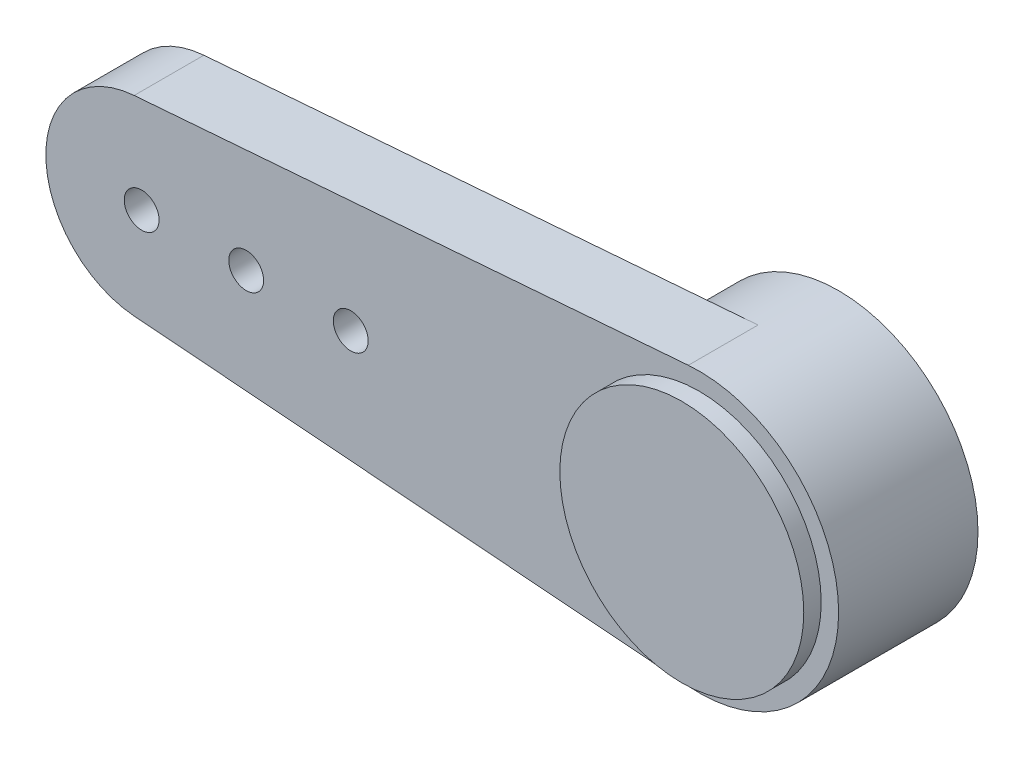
from build123d import *

# Parameters (mm, degrees)
ESQUISSE1_R      = 0.5
EXTRUSION6_DEPTH = 2
ESQUISSE2_R      = 3.5
EXTRUSION7_DEPTH = 0.5
EXTRUSION8_START = 2
ESQUISSE3_R      = 4
EXTRUSION8_DEPTH = 2
ESQUISSE4_R      = 2.5
EXTRUSION9_DEPTH = 2.7


with BuildPart() as part:
    # Esquisse1 → Extrusion6 (new body)
    with BuildSketch(Plane.XY):
        with BuildLine():
            Line((-16.21484375, 2.741594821), (-0.3125, 3.987774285))
            ThreePointArc((-0.3125, 3.987774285), (4, 0), (-0.3125, -3.987774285))
            Line((-0.3125, -3.987774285), (-16.21484375, -2.741594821))
            ThreePointArc((-16.21484375, -2.741594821), (-18.75, 0), (-16.21484375, 2.741594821))
        make_face()
        with Locations((-16, 0)):
            Circle(ESQUISSE1_R, mode=Mode.SUBTRACT)
        with Locations((-13, 0)):
            Circle(ESQUISSE1_R, mode=Mode.SUBTRACT)
        with Locations((-10, 0)):
            Circle(ESQUISSE1_R, mode=Mode.SUBTRACT)
    extrude(amount=EXTRUSION6_DEPTH)

    # Esquisse2 → Extrusion7 (add)
    with BuildSketch(Plane.XY.offset(2)):
        Circle(ESQUISSE2_R)
    extrude(amount=EXTRUSION7_DEPTH)

    # Esquisse3 → Extrusion8 (add)
    with BuildSketch(Plane(origin=(0, 0, 0), x_dir=(-1, 0, 0), z_dir=(0, 0, -1)).offset(EXTRUSION8_START)):
        Circle(ESQUISSE3_R)
    extrude(amount=-EXTRUSION8_DEPTH)

    # Esquisse4 → Extrusion9 (cut)
    with BuildSketch(Plane(origin=(0, 0, -2), x_dir=(-1, 0, 0), z_dir=(0, 0, -1))):
        Circle(ESQUISSE4_R)
    extrude(amount=-EXTRUSION9_DEPTH, mode=Mode.SUBTRACT)


solid = part.part
